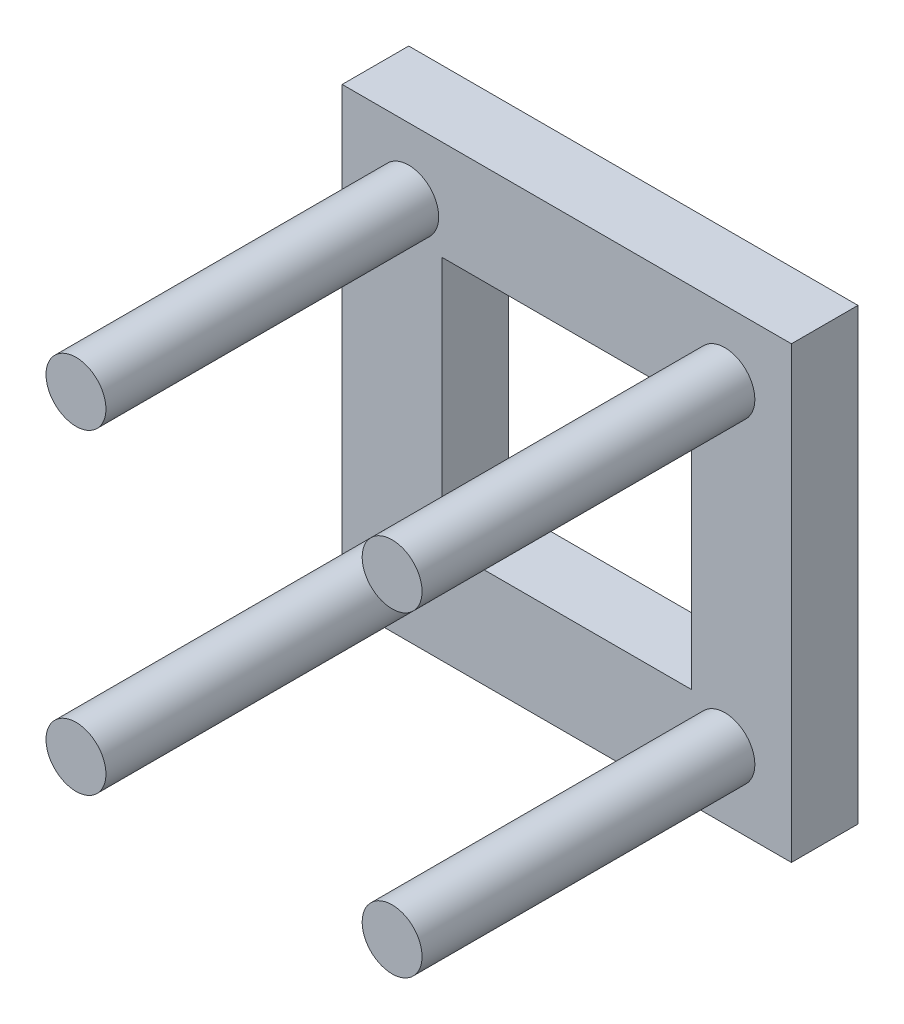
ISO-10303-21;
HEADER;
FILE_DESCRIPTION(('STEP AP214'),'2;1');
FILE_NAME('part.step','',(''),(''),'','','');
FILE_SCHEMA(('AUTOMOTIVE_DESIGN { 1 0 10303 214 1 1 1 1 }'));
ENDSEC;
DATA;
#1=APPLICATION_CONTEXT('core data for automotive mechanical design processes');
#2=APPLICATION_PROTOCOL_DEFINITION('international standard','automotive_design',2000,#1);
#3=PRODUCT_CONTEXT('',#1,'mechanical');
#4=PRODUCT('Part','Part','',(#3));
#5=PRODUCT_RELATED_PRODUCT_CATEGORY('part','',(#4));
#6=PRODUCT_DEFINITION_FORMATION('','',#4);
#7=PRODUCT_DEFINITION_CONTEXT('part definition',#1,'design');
#8=PRODUCT_DEFINITION('design','',#6,#7);
#9=PRODUCT_DEFINITION_SHAPE('','',#8);
#10=(LENGTH_UNIT() NAMED_UNIT(*) SI_UNIT(.MILLI.,.METRE.));
#11=(NAMED_UNIT(*) PLANE_ANGLE_UNIT() SI_UNIT($,.RADIAN.));
#12=(NAMED_UNIT(*) SI_UNIT($,.STERADIAN.) SOLID_ANGLE_UNIT());
#13=UNCERTAINTY_MEASURE_WITH_UNIT(LENGTH_MEASURE(1.E-05),#10,'distance_accuracy_value','');
#14=(GEOMETRIC_REPRESENTATION_CONTEXT(3) GLOBAL_UNCERTAINTY_ASSIGNED_CONTEXT((#13)) GLOBAL_UNIT_ASSIGNED_CONTEXT((#10,
#11,#12)) REPRESENTATION_CONTEXT('',''));
#15=CARTESIAN_POINT('',(0.,0.,0.));
#16=DIRECTION('',(0.,0.,1.));
#17=DIRECTION('',(1.,0.,0.));
#18=AXIS2_PLACEMENT_3D('',#15,#16,#17);
#19=CARTESIAN_POINT('',(0.,0.,-1.));
#20=DIRECTION('',(0.,0.,-1.));
#21=DIRECTION('',(-1.,0.,0.));
#22=AXIS2_PLACEMENT_3D('',#19,#20,#21);
#23=PLANE('',#22);
#24=CARTESIAN_POINT('',(-47.5,-47.5,-1.));
#25=DIRECTION('',(0.,0.,-1.));
#26=DIRECTION('',(-1.,0.,0.));
#27=AXIS2_PLACEMENT_3D('',#24,#25,#26);
#28=CIRCLE('',#27,9.);
#29=CARTESIAN_POINT('',(-56.5,-47.5,-1.));
#30=VERTEX_POINT('',#29);
#31=EDGE_CURVE('E44',#30,#30,#28,.F.);
#32=ORIENTED_EDGE('',*,*,#31,.F.);
#33=EDGE_LOOP('',(#32));
#34=FACE_BOUND('',#33,.T.);
#35=CARTESIAN_POINT('',(-47.5,47.5,-1.));
#36=DIRECTION('',(0.,0.,-1.));
#37=DIRECTION('',(-1.,0.,0.));
#38=AXIS2_PLACEMENT_3D('',#35,#36,#37);
#39=CIRCLE('',#38,9.);
#40=CARTESIAN_POINT('',(-56.5,47.5,-1.));
#41=VERTEX_POINT('',#40);
#42=EDGE_CURVE('E127',#41,#41,#39,.F.);
#43=ORIENTED_EDGE('',*,*,#42,.F.);
#44=EDGE_LOOP('',(#43));
#45=FACE_BOUND('',#44,.T.);
#46=DIRECTION('',(0.,1.,0.));
#47=VECTOR('',#46,1.);
#48=CARTESIAN_POINT('',(37.5,37.5,-1.));
#49=LINE('',#48,#47);
#50=CARTESIAN_POINT('',(37.5,-37.5,-1.));
#51=VERTEX_POINT('',#50);
#52=CARTESIAN_POINT('',(37.5,37.5,-1.));
#53=VERTEX_POINT('',#52);
#54=EDGE_CURVE('E105',#51,#53,#49,.T.);
#55=ORIENTED_EDGE('',*,*,#54,.F.);
#56=DIRECTION('',(1.,0.,0.));
#57=VECTOR('',#56,1.);
#58=CARTESIAN_POINT('',(37.5,-37.5,-1.));
#59=LINE('',#58,#57);
#60=CARTESIAN_POINT('',(-37.5,-37.5,-1.));
#61=VERTEX_POINT('',#60);
#62=EDGE_CURVE('E101',#61,#51,#59,.T.);
#63=ORIENTED_EDGE('',*,*,#62,.F.);
#64=DIRECTION('',(0.,-1.,0.));
#65=VECTOR('',#64,1.);
#66=CARTESIAN_POINT('',(-37.5,-37.5,-1.));
#67=LINE('',#66,#65);
#68=CARTESIAN_POINT('',(-37.5,37.5,-1.));
#69=VERTEX_POINT('',#68);
#70=EDGE_CURVE('E149',#69,#61,#67,.T.);
#71=ORIENTED_EDGE('',*,*,#70,.F.);
#72=DIRECTION('',(-1.,0.,0.));
#73=VECTOR('',#72,1.);
#74=CARTESIAN_POINT('',(37.5,37.5,-1.));
#75=LINE('',#74,#73);
#76=EDGE_CURVE('E106',#53,#69,#75,.T.);
#77=ORIENTED_EDGE('',*,*,#76,.F.);
#78=EDGE_LOOP('',(#55,#63,#71,#77));
#79=FACE_BOUND('',#78,.T.);
#80=DIRECTION('',(-1.,0.,0.));
#81=VECTOR('',#80,1.);
#82=CARTESIAN_POINT('',(67.5,67.5,-1.));
#83=LINE('',#82,#81);
#84=CARTESIAN_POINT('',(67.5,67.5,-1.));
#85=VERTEX_POINT('',#84);
#86=CARTESIAN_POINT('',(-67.5,67.5,-1.));
#87=VERTEX_POINT('',#86);
#88=EDGE_CURVE('E173',#85,#87,#83,.T.);
#89=ORIENTED_EDGE('',*,*,#88,.T.);
#90=DIRECTION('',(0.,-1.,0.));
#91=VECTOR('',#90,1.);
#92=CARTESIAN_POINT('',(-67.5,-67.5,-1.));
#93=LINE('',#92,#91);
#94=CARTESIAN_POINT('',(-67.5,-67.5,-1.));
#95=VERTEX_POINT('',#94);
#96=EDGE_CURVE('E354',#87,#95,#93,.T.);
#97=ORIENTED_EDGE('',*,*,#96,.T.);
#98=DIRECTION('',(1.,0.,0.));
#99=VECTOR('',#98,1.);
#100=CARTESIAN_POINT('',(67.5,-67.5,-1.));
#101=LINE('',#100,#99);
#102=CARTESIAN_POINT('',(67.5,-67.5,-1.));
#103=VERTEX_POINT('',#102);
#104=EDGE_CURVE('E352',#95,#103,#101,.T.);
#105=ORIENTED_EDGE('',*,*,#104,.T.);
#106=DIRECTION('',(0.,1.,0.));
#107=VECTOR('',#106,1.);
#108=CARTESIAN_POINT('',(67.5,67.5,-1.));
#109=LINE('',#108,#107);
#110=EDGE_CURVE('E121',#103,#85,#109,.T.);
#111=ORIENTED_EDGE('',*,*,#110,.T.);
#112=EDGE_LOOP('',(#89,#97,#105,#111));
#113=FACE_BOUND('',#112,.T.);
#114=CARTESIAN_POINT('',(47.5,47.5,-1.));
#115=DIRECTION('',(0.,0.,-1.));
#116=DIRECTION('',(-1.,0.,0.));
#117=AXIS2_PLACEMENT_3D('',#114,#115,#116);
#118=CIRCLE('',#117,9.);
#119=CARTESIAN_POINT('',(38.5,47.5,-1.));
#120=VERTEX_POINT('',#119);
#121=EDGE_CURVE('E153',#120,#120,#118,.F.);
#122=ORIENTED_EDGE('',*,*,#121,.F.);
#123=EDGE_LOOP('',(#122));
#124=FACE_BOUND('',#123,.T.);
#125=CARTESIAN_POINT('',(47.5,-47.5,-1.));
#126=DIRECTION('',(0.,0.,-1.));
#127=DIRECTION('',(-1.,0.,0.));
#128=AXIS2_PLACEMENT_3D('',#125,#126,#127);
#129=CIRCLE('',#128,9.);
#130=CARTESIAN_POINT('',(38.5,-47.5,-1.));
#131=VERTEX_POINT('',#130);
#132=EDGE_CURVE('E11',#131,#131,#129,.F.);
#133=ORIENTED_EDGE('',*,*,#132,.F.);
#134=EDGE_LOOP('',(#133));
#135=FACE_BOUND('',#134,.T.);
#136=ADVANCED_FACE('F35',(#34,#45,#79,#113,#124,#135),#23,.F.);
#137=CARTESIAN_POINT('',(67.5,67.5,-211.918830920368));
#138=DIRECTION('',(0.,1.,0.));
#139=DIRECTION('',(0.,0.,1.));
#140=AXIS2_PLACEMENT_3D('',#137,#138,#139);
#141=PLANE('',#140);
#142=DIRECTION('',(0.,0.,1.));
#143=VECTOR('',#142,1.);
#144=CARTESIAN_POINT('',(67.5,67.5,-211.918830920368));
#145=LINE('',#144,#143);
#146=CARTESIAN_POINT('',(67.5,67.5,-21.));
#147=VERTEX_POINT('',#146);
#148=EDGE_CURVE('E135',#147,#85,#145,.T.);
#149=ORIENTED_EDGE('',*,*,#148,.F.);
#150=DIRECTION('',(-1.,0.,0.));
#151=VECTOR('',#150,1.);
#152=CARTESIAN_POINT('',(67.5,67.5,-21.));
#153=LINE('',#152,#151);
#154=CARTESIAN_POINT('',(-67.5,67.5,-21.));
#155=VERTEX_POINT('',#154);
#156=EDGE_CURVE('E128',#147,#155,#153,.T.);
#157=ORIENTED_EDGE('',*,*,#156,.T.);
#158=DIRECTION('',(0.,0.,1.));
#159=VECTOR('',#158,1.);
#160=CARTESIAN_POINT('',(-67.5,67.5,-211.918830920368));
#161=LINE('',#160,#159);
#162=EDGE_CURVE('E130',#155,#87,#161,.T.);
#163=ORIENTED_EDGE('',*,*,#162,.T.);
#164=ORIENTED_EDGE('',*,*,#88,.F.);
#165=EDGE_LOOP('',(#149,#157,#163,#164));
#166=FACE_BOUND('',#165,.T.);
#167=ADVANCED_FACE('F162',(#166),#141,.T.);
#168=CARTESIAN_POINT('',(67.5,67.5,-211.918830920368));
#169=DIRECTION('',(1.,0.,0.));
#170=DIRECTION('',(0.,0.,-1.));
#171=AXIS2_PLACEMENT_3D('',#168,#169,#170);
#172=PLANE('',#171);
#173=DIRECTION('',(0.,0.,1.));
#174=VECTOR('',#173,1.);
#175=CARTESIAN_POINT('',(67.5,-67.5,-211.918830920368));
#176=LINE('',#175,#174);
#177=CARTESIAN_POINT('',(67.5,-67.5,-21.));
#178=VERTEX_POINT('',#177);
#179=EDGE_CURVE('E138',#178,#103,#176,.T.);
#180=ORIENTED_EDGE('',*,*,#179,.F.);
#181=DIRECTION('',(0.,1.,0.));
#182=VECTOR('',#181,1.);
#183=CARTESIAN_POINT('',(67.5,67.5,-21.));
#184=LINE('',#183,#182);
#185=EDGE_CURVE('E132',#178,#147,#184,.T.);
#186=ORIENTED_EDGE('',*,*,#185,.T.);
#187=ORIENTED_EDGE('',*,*,#148,.T.);
#188=ORIENTED_EDGE('',*,*,#110,.F.);
#189=EDGE_LOOP('',(#180,#186,#187,#188));
#190=FACE_BOUND('',#189,.T.);
#191=ADVANCED_FACE('F220',(#190),#172,.T.);
#192=CARTESIAN_POINT('',(67.5,-67.5,-211.918830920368));
#193=DIRECTION('',(0.,-1.,0.));
#194=DIRECTION('',(0.,0.,-1.));
#195=AXIS2_PLACEMENT_3D('',#192,#193,#194);
#196=PLANE('',#195);
#197=DIRECTION('',(0.,0.,1.));
#198=VECTOR('',#197,1.);
#199=CARTESIAN_POINT('',(-67.5,-67.5,-211.918830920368));
#200=LINE('',#199,#198);
#201=CARTESIAN_POINT('',(-67.5,-67.5,-21.));
#202=VERTEX_POINT('',#201);
#203=EDGE_CURVE('E142',#202,#95,#200,.T.);
#204=ORIENTED_EDGE('',*,*,#203,.F.);
#205=DIRECTION('',(1.,0.,0.));
#206=VECTOR('',#205,1.);
#207=CARTESIAN_POINT('',(67.5,-67.5,-21.));
#208=LINE('',#207,#206);
#209=EDGE_CURVE('E136',#202,#178,#208,.T.);
#210=ORIENTED_EDGE('',*,*,#209,.T.);
#211=ORIENTED_EDGE('',*,*,#179,.T.);
#212=ORIENTED_EDGE('',*,*,#104,.F.);
#213=EDGE_LOOP('',(#204,#210,#211,#212));
#214=FACE_BOUND('',#213,.T.);
#215=ADVANCED_FACE('F216',(#214),#196,.T.);
#216=CARTESIAN_POINT('',(-67.5,-67.5,-211.918830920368));
#217=DIRECTION('',(-1.,0.,0.));
#218=DIRECTION('',(0.,0.,1.));
#219=AXIS2_PLACEMENT_3D('',#216,#217,#218);
#220=PLANE('',#219);
#221=ORIENTED_EDGE('',*,*,#162,.F.);
#222=DIRECTION('',(0.,-1.,0.));
#223=VECTOR('',#222,1.);
#224=CARTESIAN_POINT('',(-67.5,-67.5,-21.));
#225=LINE('',#224,#223);
#226=EDGE_CURVE('E51',#155,#202,#225,.T.);
#227=ORIENTED_EDGE('',*,*,#226,.T.);
#228=ORIENTED_EDGE('',*,*,#203,.T.);
#229=ORIENTED_EDGE('',*,*,#96,.F.);
#230=EDGE_LOOP('',(#221,#227,#228,#229));
#231=FACE_BOUND('',#230,.T.);
#232=ADVANCED_FACE('F213',(#231),#220,.T.);
#233=CARTESIAN_POINT('',(37.5,-37.5,-211.918830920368));
#234=DIRECTION('',(0.,-1.,0.));
#235=DIRECTION('',(0.,0.,-1.));
#236=AXIS2_PLACEMENT_3D('',#233,#234,#235);
#237=PLANE('',#236);
#238=DIRECTION('',(1.,0.,0.));
#239=VECTOR('',#238,1.);
#240=CARTESIAN_POINT('',(37.5,-37.5,-21.));
#241=LINE('',#240,#239);
#242=CARTESIAN_POINT('',(-37.5,-37.5,-21.));
#243=VERTEX_POINT('',#242);
#244=CARTESIAN_POINT('',(37.5,-37.5,-21.));
#245=VERTEX_POINT('',#244);
#246=EDGE_CURVE('E98',#243,#245,#241,.T.);
#247=ORIENTED_EDGE('',*,*,#246,.F.);
#248=DIRECTION('',(0.,0.,1.));
#249=VECTOR('',#248,1.);
#250=CARTESIAN_POINT('',(-37.5,-37.5,-211.918830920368));
#251=LINE('',#250,#249);
#252=EDGE_CURVE('E144',#243,#61,#251,.T.);
#253=ORIENTED_EDGE('',*,*,#252,.T.);
#254=ORIENTED_EDGE('',*,*,#62,.T.);
#255=DIRECTION('',(0.,0.,1.));
#256=VECTOR('',#255,1.);
#257=CARTESIAN_POINT('',(37.5,-37.5,-211.918830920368));
#258=LINE('',#257,#256);
#259=EDGE_CURVE('E94',#245,#51,#258,.T.);
#260=ORIENTED_EDGE('',*,*,#259,.F.);
#261=EDGE_LOOP('',(#247,#253,#254,#260));
#262=FACE_BOUND('',#261,.T.);
#263=ADVANCED_FACE('F96',(#262),#237,.F.);
#264=CARTESIAN_POINT('',(-37.5,-37.5,-211.918830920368));
#265=DIRECTION('',(-1.,0.,0.));
#266=DIRECTION('',(0.,0.,1.));
#267=AXIS2_PLACEMENT_3D('',#264,#265,#266);
#268=PLANE('',#267);
#269=DIRECTION('',(0.,-1.,0.));
#270=VECTOR('',#269,1.);
#271=CARTESIAN_POINT('',(-37.5,-37.5,-21.));
#272=LINE('',#271,#270);
#273=CARTESIAN_POINT('',(-37.5,37.5,-21.));
#274=VERTEX_POINT('',#273);
#275=EDGE_CURVE('E119',#274,#243,#272,.T.);
#276=ORIENTED_EDGE('',*,*,#275,.F.);
#277=DIRECTION('',(0.,0.,1.));
#278=VECTOR('',#277,1.);
#279=CARTESIAN_POINT('',(-37.5,37.5,-211.918830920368));
#280=LINE('',#279,#278);
#281=EDGE_CURVE('E147',#274,#69,#280,.T.);
#282=ORIENTED_EDGE('',*,*,#281,.T.);
#283=ORIENTED_EDGE('',*,*,#70,.T.);
#284=ORIENTED_EDGE('',*,*,#252,.F.);
#285=EDGE_LOOP('',(#276,#282,#283,#284));
#286=FACE_BOUND('',#285,.T.);
#287=ADVANCED_FACE('F233',(#286),#268,.F.);
#288=CARTESIAN_POINT('',(37.5,37.5,-211.918830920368));
#289=DIRECTION('',(0.,1.,0.));
#290=DIRECTION('',(0.,0.,1.));
#291=AXIS2_PLACEMENT_3D('',#288,#289,#290);
#292=PLANE('',#291);
#293=DIRECTION('',(-1.,0.,0.));
#294=VECTOR('',#293,1.);
#295=CARTESIAN_POINT('',(37.5,37.5,-21.));
#296=LINE('',#295,#294);
#297=CARTESIAN_POINT('',(37.5,37.5,-21.));
#298=VERTEX_POINT('',#297);
#299=EDGE_CURVE('E116',#298,#274,#296,.T.);
#300=ORIENTED_EDGE('',*,*,#299,.F.);
#301=DIRECTION('',(0.,0.,1.));
#302=VECTOR('',#301,1.);
#303=CARTESIAN_POINT('',(37.5,37.5,-211.918830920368));
#304=LINE('',#303,#302);
#305=EDGE_CURVE('E112',#298,#53,#304,.T.);
#306=ORIENTED_EDGE('',*,*,#305,.T.);
#307=ORIENTED_EDGE('',*,*,#76,.T.);
#308=ORIENTED_EDGE('',*,*,#281,.F.);
#309=EDGE_LOOP('',(#300,#306,#307,#308));
#310=FACE_BOUND('',#309,.T.);
#311=ADVANCED_FACE('F230',(#310),#292,.F.);
#312=CARTESIAN_POINT('',(37.5,37.5,-211.918830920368));
#313=DIRECTION('',(1.,0.,0.));
#314=DIRECTION('',(0.,0.,-1.));
#315=AXIS2_PLACEMENT_3D('',#312,#313,#314);
#316=PLANE('',#315);
#317=DIRECTION('',(0.,1.,0.));
#318=VECTOR('',#317,1.);
#319=CARTESIAN_POINT('',(37.5,37.5,-21.));
#320=LINE('',#319,#318);
#321=EDGE_CURVE('E110',#245,#298,#320,.T.);
#322=ORIENTED_EDGE('',*,*,#321,.F.);
#323=ORIENTED_EDGE('',*,*,#259,.T.);
#324=ORIENTED_EDGE('',*,*,#54,.T.);
#325=ORIENTED_EDGE('',*,*,#305,.F.);
#326=EDGE_LOOP('',(#322,#323,#324,#325));
#327=FACE_BOUND('',#326,.T.);
#328=ADVANCED_FACE('F111',(#327),#316,.F.);
#329=CARTESIAN_POINT('',(0.,0.,-21.));
#330=DIRECTION('',(0.,0.,-1.));
#331=DIRECTION('',(-1.,0.,0.));
#332=AXIS2_PLACEMENT_3D('',#329,#330,#331);
#333=PLANE('',#332);
#334=ORIENTED_EDGE('',*,*,#156,.F.);
#335=ORIENTED_EDGE('',*,*,#185,.F.);
#336=ORIENTED_EDGE('',*,*,#209,.F.);
#337=ORIENTED_EDGE('',*,*,#226,.F.);
#338=EDGE_LOOP('',(#334,#335,#336,#337));
#339=FACE_BOUND('',#338,.T.);
#340=ORIENTED_EDGE('',*,*,#275,.T.);
#341=ORIENTED_EDGE('',*,*,#246,.T.);
#342=ORIENTED_EDGE('',*,*,#321,.T.);
#343=ORIENTED_EDGE('',*,*,#299,.T.);
#344=EDGE_LOOP('',(#340,#341,#342,#343));
#345=FACE_BOUND('',#344,.T.);
#346=ADVANCED_FACE('F37',(#339,#345),#333,.T.);
#347=CARTESIAN_POINT('',(-47.5,47.5,99.));
#348=DIRECTION('',(0.,0.,-1.));
#349=DIRECTION('',(-1.,0.,0.));
#350=AXIS2_PLACEMENT_3D('',#347,#348,#349);
#351=CYLINDRICAL_SURFACE('',#350,9.);
#352=CARTESIAN_POINT('',(-47.5,47.5,99.));
#353=DIRECTION('',(0.,0.,1.));
#354=DIRECTION('',(1.,0.,0.));
#355=AXIS2_PLACEMENT_3D('',#352,#353,#354);
#356=CIRCLE('',#355,9.);
#357=CARTESIAN_POINT('',(-38.5,47.5,99.));
#358=VERTEX_POINT('',#357);
#359=EDGE_CURVE('E131',#358,#358,#356,.T.);
#360=ORIENTED_EDGE('',*,*,#359,.F.);
#361=EDGE_LOOP('',(#360));
#362=FACE_BOUND('',#361,.T.);
#363=ORIENTED_EDGE('',*,*,#42,.T.);
#364=EDGE_LOOP('',(#363));
#365=FACE_BOUND('',#364,.T.);
#366=ADVANCED_FACE('F208',(#362,#365),#351,.T.);
#367=CARTESIAN_POINT('',(-47.5,47.5,99.));
#368=DIRECTION('',(0.,0.,1.));
#369=DIRECTION('',(1.,0.,0.));
#370=AXIS2_PLACEMENT_3D('',#367,#368,#369);
#371=PLANE('',#370);
#372=ORIENTED_EDGE('',*,*,#359,.T.);
#373=EDGE_LOOP('',(#372));
#374=FACE_BOUND('',#373,.T.);
#375=ADVANCED_FACE('F204',(#374),#371,.T.);
#376=CARTESIAN_POINT('',(47.5,47.5,99.));
#377=DIRECTION('',(0.,0.,-1.));
#378=DIRECTION('',(-1.,0.,0.));
#379=AXIS2_PLACEMENT_3D('',#376,#377,#378);
#380=CYLINDRICAL_SURFACE('',#379,9.);
#381=CARTESIAN_POINT('',(47.5,47.5,99.));
#382=DIRECTION('',(0.,0.,1.));
#383=DIRECTION('',(1.,0.,0.));
#384=AXIS2_PLACEMENT_3D('',#381,#382,#383);
#385=CIRCLE('',#384,9.);
#386=CARTESIAN_POINT('',(56.5,47.5,99.));
#387=VERTEX_POINT('',#386);
#388=EDGE_CURVE('E369',#387,#387,#385,.T.);
#389=ORIENTED_EDGE('',*,*,#388,.F.);
#390=EDGE_LOOP('',(#389));
#391=FACE_BOUND('',#390,.T.);
#392=ORIENTED_EDGE('',*,*,#121,.T.);
#393=EDGE_LOOP('',(#392));
#394=FACE_BOUND('',#393,.T.);
#395=ADVANCED_FACE('F200',(#391,#394),#380,.T.);
#396=CARTESIAN_POINT('',(47.5,47.5,99.));
#397=DIRECTION('',(0.,0.,1.));
#398=DIRECTION('',(1.,0.,0.));
#399=AXIS2_PLACEMENT_3D('',#396,#397,#398);
#400=PLANE('',#399);
#401=ORIENTED_EDGE('',*,*,#388,.T.);
#402=EDGE_LOOP('',(#401));
#403=FACE_BOUND('',#402,.T.);
#404=ADVANCED_FACE('F196',(#403),#400,.T.);
#405=CARTESIAN_POINT('',(-47.5,-47.5,99.));
#406=DIRECTION('',(0.,0.,-1.));
#407=DIRECTION('',(-1.,0.,0.));
#408=AXIS2_PLACEMENT_3D('',#405,#406,#407);
#409=CYLINDRICAL_SURFACE('',#408,9.);
#410=CARTESIAN_POINT('',(-47.5,-47.5,99.));
#411=DIRECTION('',(0.,0.,1.));
#412=DIRECTION('',(1.,0.,0.));
#413=AXIS2_PLACEMENT_3D('',#410,#411,#412);
#414=CIRCLE('',#413,9.);
#415=CARTESIAN_POINT('',(-38.5,-47.5,99.));
#416=VERTEX_POINT('',#415);
#417=EDGE_CURVE('E372',#416,#416,#414,.T.);
#418=ORIENTED_EDGE('',*,*,#417,.F.);
#419=EDGE_LOOP('',(#418));
#420=FACE_BOUND('',#419,.T.);
#421=ORIENTED_EDGE('',*,*,#31,.T.);
#422=EDGE_LOOP('',(#421));
#423=FACE_BOUND('',#422,.T.);
#424=ADVANCED_FACE('F158',(#420,#423),#409,.T.);
#425=CARTESIAN_POINT('',(-47.5,-47.5,99.));
#426=DIRECTION('',(0.,0.,1.));
#427=DIRECTION('',(1.,0.,0.));
#428=AXIS2_PLACEMENT_3D('',#425,#426,#427);
#429=PLANE('',#428);
#430=ORIENTED_EDGE('',*,*,#417,.T.);
#431=EDGE_LOOP('',(#430));
#432=FACE_BOUND('',#431,.T.);
#433=ADVANCED_FACE('F181',(#432),#429,.T.);
#434=CARTESIAN_POINT('',(47.5,-47.5,99.));
#435=DIRECTION('',(0.,0.,-1.));
#436=DIRECTION('',(-1.,0.,0.));
#437=AXIS2_PLACEMENT_3D('',#434,#435,#436);
#438=CYLINDRICAL_SURFACE('',#437,9.);
#439=CARTESIAN_POINT('',(47.5,-47.5,99.));
#440=DIRECTION('',(0.,0.,1.));
#441=DIRECTION('',(1.,0.,0.));
#442=AXIS2_PLACEMENT_3D('',#439,#440,#441);
#443=CIRCLE('',#442,9.);
#444=CARTESIAN_POINT('',(56.5,-47.5,99.));
#445=VERTEX_POINT('',#444);
#446=EDGE_CURVE('E375',#445,#445,#443,.T.);
#447=ORIENTED_EDGE('',*,*,#446,.F.);
#448=EDGE_LOOP('',(#447));
#449=FACE_BOUND('',#448,.T.);
#450=ORIENTED_EDGE('',*,*,#132,.T.);
#451=EDGE_LOOP('',(#450));
#452=FACE_BOUND('',#451,.T.);
#453=ADVANCED_FACE('F178',(#449,#452),#438,.T.);
#454=CARTESIAN_POINT('',(47.5,-47.5,99.));
#455=DIRECTION('',(0.,0.,1.));
#456=DIRECTION('',(1.,0.,0.));
#457=AXIS2_PLACEMENT_3D('',#454,#455,#456);
#458=PLANE('',#457);
#459=ORIENTED_EDGE('',*,*,#446,.T.);
#460=EDGE_LOOP('',(#459));
#461=FACE_BOUND('',#460,.T.);
#462=ADVANCED_FACE('F180',(#461),#458,.T.);
#463=CLOSED_SHELL('',(#136,#167,#191,#215,#232,#263,#287,#311,#328,#346,#366,#375,#395,#404,
#424,#433,#453,#462));
#464=MANIFOLD_SOLID_BREP('B2',#463);
#465=ADVANCED_BREP_SHAPE_REPRESENTATION('',(#18,#464),#14);
#466=SHAPE_DEFINITION_REPRESENTATION(#9,#465);
ENDSEC;
END-ISO-10303-21;
